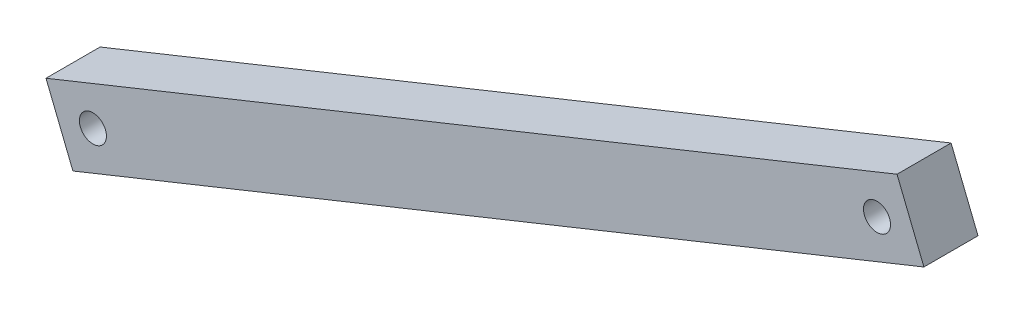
ISO-10303-21;
HEADER;
FILE_DESCRIPTION(('STEP AP214'),'2;1');
FILE_NAME('part.step','',(''),(''),'','','');
FILE_SCHEMA(('AUTOMOTIVE_DESIGN { 1 0 10303 214 1 1 1 1 }'));
ENDSEC;
DATA;
#1=APPLICATION_CONTEXT('core data for automotive mechanical design processes');
#2=APPLICATION_PROTOCOL_DEFINITION('international standard','automotive_design',2000,#1);
#3=PRODUCT_CONTEXT('',#1,'mechanical');
#4=PRODUCT('Part','Part','',(#3));
#5=PRODUCT_RELATED_PRODUCT_CATEGORY('part','',(#4));
#6=PRODUCT_DEFINITION_FORMATION('','',#4);
#7=PRODUCT_DEFINITION_CONTEXT('part definition',#1,'design');
#8=PRODUCT_DEFINITION('design','',#6,#7);
#9=PRODUCT_DEFINITION_SHAPE('','',#8);
#10=(LENGTH_UNIT() NAMED_UNIT(*) SI_UNIT(.MILLI.,.METRE.));
#11=(NAMED_UNIT(*) PLANE_ANGLE_UNIT() SI_UNIT($,.RADIAN.));
#12=(NAMED_UNIT(*) SI_UNIT($,.STERADIAN.) SOLID_ANGLE_UNIT());
#13=UNCERTAINTY_MEASURE_WITH_UNIT(LENGTH_MEASURE(1.E-05),#10,'distance_accuracy_value','');
#14=(GEOMETRIC_REPRESENTATION_CONTEXT(3) GLOBAL_UNCERTAINTY_ASSIGNED_CONTEXT((#13)) GLOBAL_UNIT_ASSIGNED_CONTEXT((#10,
#11,#12)) REPRESENTATION_CONTEXT('',''));
#15=CARTESIAN_POINT('',(0.,0.,0.));
#16=DIRECTION('',(0.,0.,1.));
#17=DIRECTION('',(1.,0.,0.));
#18=AXIS2_PLACEMENT_3D('',#15,#16,#17);
#19=CARTESIAN_POINT('',(-5.20387182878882,89.2180437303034,6.));
#20=DIRECTION('',(0.,0.,1.));
#21=DIRECTION('',(1.,0.,0.));
#22=AXIS2_PLACEMENT_3D('',#19,#20,#21);
#23=PLANE('',#22);
#24=CARTESIAN_POINT('',(87.,122.,6.));
#25=DIRECTION('',(0.,0.,1.));
#26=DIRECTION('',(1.,0.,0.));
#27=AXIS2_PLACEMENT_3D('',#24,#25,#26);
#28=CIRCLE('',#27,1.5);
#29=CARTESIAN_POINT('',(88.5,122.,6.));
#30=VERTEX_POINT('',#29);
#31=EDGE_CURVE('E85',#30,#30,#28,.T.);
#32=ORIENTED_EDGE('',*,*,#31,.F.);
#33=EDGE_LOOP('',(#32));
#34=FACE_BOUND('',#33,.T.);
#35=DIRECTION('',(-0.927739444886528,-0.373228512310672,0.));
#36=VECTOR('',#35,1.);
#37=CARTESIAN_POINT('',(89.2180437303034,127.203871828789,6.));
#38=LINE('',#37,#36);
#39=CARTESIAN_POINT('',(89.2180437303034,127.203871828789,6.));
#40=VERTEX_POINT('',#39);
#41=CARTESIAN_POINT('',(-5.20387182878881,89.2180437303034,6.));
#42=VERTEX_POINT('',#41);
#43=EDGE_CURVE('E95',#40,#42,#38,.T.);
#44=ORIENTED_EDGE('',*,*,#43,.T.);
#45=DIRECTION('',(0.373228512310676,-0.927739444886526,0.));
#46=VECTOR('',#45,1.);
#47=CARTESIAN_POINT('',(-5.20387182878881,89.2180437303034,6.));
#48=LINE('',#47,#46);
#49=CARTESIAN_POINT('',(-2.21804373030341,81.7961281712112,6.));
#50=VERTEX_POINT('',#49);
#51=EDGE_CURVE('E80',#42,#50,#48,.T.);
#52=ORIENTED_EDGE('',*,*,#51,.T.);
#53=DIRECTION('',(0.927739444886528,0.373228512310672,0.));
#54=VECTOR('',#53,1.);
#55=CARTESIAN_POINT('',(-2.21804373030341,81.7961281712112,6.));
#56=LINE('',#55,#54);
#57=CARTESIAN_POINT('',(92.2038718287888,119.781956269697,6.));
#58=VERTEX_POINT('',#57);
#59=EDGE_CURVE('E46',#50,#58,#56,.T.);
#60=ORIENTED_EDGE('',*,*,#59,.T.);
#61=DIRECTION('',(-0.373228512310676,0.927739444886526,0.));
#62=VECTOR('',#61,1.);
#63=CARTESIAN_POINT('',(89.2180437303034,127.203871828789,6.));
#64=LINE('',#63,#62);
#65=EDGE_CURVE('E41',#58,#40,#64,.T.);
#66=ORIENTED_EDGE('',*,*,#65,.T.);
#67=EDGE_LOOP('',(#44,#52,#60,#66));
#68=FACE_BOUND('',#67,.T.);
#69=CARTESIAN_POINT('',(0.,87.,6.));
#70=DIRECTION('',(0.,0.,1.));
#71=DIRECTION('',(1.,0.,0.));
#72=AXIS2_PLACEMENT_3D('',#69,#70,#71);
#73=CIRCLE('',#72,1.5);
#74=CARTESIAN_POINT('',(1.5,87.,6.));
#75=VERTEX_POINT('',#74);
#76=EDGE_CURVE('E113',#75,#75,#73,.T.);
#77=ORIENTED_EDGE('',*,*,#76,.F.);
#78=EDGE_LOOP('',(#77));
#79=FACE_BOUND('',#78,.T.);
#80=ADVANCED_FACE('F26',(#34,#68,#79),#23,.T.);
#81=CARTESIAN_POINT('',(-5.20387182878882,89.2180437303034,0.));
#82=DIRECTION('',(0.,0.,1.));
#83=DIRECTION('',(1.,0.,0.));
#84=AXIS2_PLACEMENT_3D('',#81,#82,#83);
#85=PLANE('',#84);
#86=CARTESIAN_POINT('',(87.,122.,0.));
#87=DIRECTION('',(0.,0.,1.));
#88=DIRECTION('',(1.,0.,0.));
#89=AXIS2_PLACEMENT_3D('',#86,#87,#88);
#90=CIRCLE('',#89,1.5);
#91=CARTESIAN_POINT('',(88.5,122.,0.));
#92=VERTEX_POINT('',#91);
#93=EDGE_CURVE('E88',#92,#92,#90,.T.);
#94=ORIENTED_EDGE('',*,*,#93,.T.);
#95=EDGE_LOOP('',(#94));
#96=FACE_BOUND('',#95,.T.);
#97=DIRECTION('',(-0.927739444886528,-0.373228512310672,0.));
#98=VECTOR('',#97,1.);
#99=CARTESIAN_POINT('',(89.2180437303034,127.203871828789,0.));
#100=LINE('',#99,#98);
#101=CARTESIAN_POINT('',(89.2180437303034,127.203871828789,0.));
#102=VERTEX_POINT('',#101);
#103=CARTESIAN_POINT('',(-5.20387182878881,89.2180437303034,0.));
#104=VERTEX_POINT('',#103);
#105=EDGE_CURVE('E72',#102,#104,#100,.T.);
#106=ORIENTED_EDGE('',*,*,#105,.F.);
#107=DIRECTION('',(-0.373228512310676,0.927739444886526,0.));
#108=VECTOR('',#107,1.);
#109=CARTESIAN_POINT('',(89.2180437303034,127.203871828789,0.));
#110=LINE('',#109,#108);
#111=CARTESIAN_POINT('',(92.2038718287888,119.781956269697,0.));
#112=VERTEX_POINT('',#111);
#113=EDGE_CURVE('E93',#112,#102,#110,.T.);
#114=ORIENTED_EDGE('',*,*,#113,.F.);
#115=DIRECTION('',(0.927739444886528,0.373228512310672,0.));
#116=VECTOR('',#115,1.);
#117=CARTESIAN_POINT('',(-2.21804373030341,81.7961281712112,0.));
#118=LINE('',#117,#116);
#119=CARTESIAN_POINT('',(-2.21804373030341,81.7961281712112,0.));
#120=VERTEX_POINT('',#119);
#121=EDGE_CURVE('E73',#120,#112,#118,.T.);
#122=ORIENTED_EDGE('',*,*,#121,.F.);
#123=DIRECTION('',(0.373228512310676,-0.927739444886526,0.));
#124=VECTOR('',#123,1.);
#125=CARTESIAN_POINT('',(-5.20387182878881,89.2180437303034,0.));
#126=LINE('',#125,#124);
#127=EDGE_CURVE('E67',#104,#120,#126,.T.);
#128=ORIENTED_EDGE('',*,*,#127,.F.);
#129=EDGE_LOOP('',(#106,#114,#122,#128));
#130=FACE_BOUND('',#129,.T.);
#131=CARTESIAN_POINT('',(0.,87.,0.));
#132=DIRECTION('',(0.,0.,1.));
#133=DIRECTION('',(1.,0.,0.));
#134=AXIS2_PLACEMENT_3D('',#131,#132,#133);
#135=CIRCLE('',#134,1.5);
#136=CARTESIAN_POINT('',(1.5,87.,0.));
#137=VERTEX_POINT('',#136);
#138=EDGE_CURVE('E115',#137,#137,#135,.T.);
#139=ORIENTED_EDGE('',*,*,#138,.T.);
#140=EDGE_LOOP('',(#139));
#141=FACE_BOUND('',#140,.T.);
#142=ADVANCED_FACE('F68',(#96,#130,#141),#85,.F.);
#143=CARTESIAN_POINT('',(89.2180437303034,127.203871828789,6.));
#144=DIRECTION('',(0.373228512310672,-0.927739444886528,0.));
#145=DIRECTION('',(0.927739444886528,0.373228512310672,0.));
#146=AXIS2_PLACEMENT_3D('',#143,#144,#145);
#147=PLANE('',#146);
#148=ORIENTED_EDGE('',*,*,#105,.T.);
#149=DIRECTION('',(0.,0.,-1.));
#150=VECTOR('',#149,1.);
#151=CARTESIAN_POINT('',(-5.20387182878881,89.2180437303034,6.));
#152=LINE('',#151,#150);
#153=EDGE_CURVE('E11',#42,#104,#152,.T.);
#154=ORIENTED_EDGE('',*,*,#153,.F.);
#155=ORIENTED_EDGE('',*,*,#43,.F.);
#156=DIRECTION('',(0.,0.,-1.));
#157=VECTOR('',#156,1.);
#158=CARTESIAN_POINT('',(89.2180437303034,127.203871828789,6.));
#159=LINE('',#158,#157);
#160=EDGE_CURVE('E84',#40,#102,#159,.T.);
#161=ORIENTED_EDGE('',*,*,#160,.T.);
#162=EDGE_LOOP('',(#148,#154,#155,#161));
#163=FACE_BOUND('',#162,.T.);
#164=ADVANCED_FACE('F28',(#163),#147,.F.);
#165=CARTESIAN_POINT('',(-5.20387182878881,89.2180437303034,6.));
#166=DIRECTION('',(0.927739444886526,0.373228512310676,0.));
#167=DIRECTION('',(-0.373228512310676,0.927739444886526,0.));
#168=AXIS2_PLACEMENT_3D('',#165,#166,#167);
#169=PLANE('',#168);
#170=ORIENTED_EDGE('',*,*,#127,.T.);
#171=DIRECTION('',(0.,0.,-1.));
#172=VECTOR('',#171,1.);
#173=CARTESIAN_POINT('',(-2.21804373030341,81.7961281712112,6.));
#174=LINE('',#173,#172);
#175=EDGE_CURVE('E34',#50,#120,#174,.T.);
#176=ORIENTED_EDGE('',*,*,#175,.F.);
#177=ORIENTED_EDGE('',*,*,#51,.F.);
#178=ORIENTED_EDGE('',*,*,#153,.T.);
#179=EDGE_LOOP('',(#170,#176,#177,#178));
#180=FACE_BOUND('',#179,.T.);
#181=ADVANCED_FACE('F79',(#180),#169,.F.);
#182=CARTESIAN_POINT('',(-2.21804373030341,81.7961281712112,6.));
#183=DIRECTION('',(-0.373228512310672,0.927739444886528,0.));
#184=DIRECTION('',(-0.927739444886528,-0.373228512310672,0.));
#185=AXIS2_PLACEMENT_3D('',#182,#183,#184);
#186=PLANE('',#185);
#187=ORIENTED_EDGE('',*,*,#121,.T.);
#188=DIRECTION('',(0.,0.,-1.));
#189=VECTOR('',#188,1.);
#190=CARTESIAN_POINT('',(92.2038718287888,119.781956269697,6.));
#191=LINE('',#190,#189);
#192=EDGE_CURVE('E101',#58,#112,#191,.T.);
#193=ORIENTED_EDGE('',*,*,#192,.F.);
#194=ORIENTED_EDGE('',*,*,#59,.F.);
#195=ORIENTED_EDGE('',*,*,#175,.T.);
#196=EDGE_LOOP('',(#187,#193,#194,#195));
#197=FACE_BOUND('',#196,.T.);
#198=ADVANCED_FACE('F104',(#197),#186,.F.);
#199=CARTESIAN_POINT('',(89.2180437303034,127.203871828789,6.));
#200=DIRECTION('',(-0.927739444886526,-0.373228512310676,0.));
#201=DIRECTION('',(0.373228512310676,-0.927739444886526,0.));
#202=AXIS2_PLACEMENT_3D('',#199,#200,#201);
#203=PLANE('',#202);
#204=ORIENTED_EDGE('',*,*,#113,.T.);
#205=ORIENTED_EDGE('',*,*,#160,.F.);
#206=ORIENTED_EDGE('',*,*,#65,.F.);
#207=ORIENTED_EDGE('',*,*,#192,.T.);
#208=EDGE_LOOP('',(#204,#205,#206,#207));
#209=FACE_BOUND('',#208,.T.);
#210=ADVANCED_FACE('F106',(#209),#203,.F.);
#211=CARTESIAN_POINT('',(87.,122.,6.));
#212=DIRECTION('',(0.,0.,-1.));
#213=DIRECTION('',(-1.,0.,0.));
#214=AXIS2_PLACEMENT_3D('',#211,#212,#213);
#215=CYLINDRICAL_SURFACE('',#214,1.5);
#216=ORIENTED_EDGE('',*,*,#31,.T.);
#217=EDGE_LOOP('',(#216));
#218=FACE_BOUND('',#217,.T.);
#219=ORIENTED_EDGE('',*,*,#93,.F.);
#220=EDGE_LOOP('',(#219));
#221=FACE_BOUND('',#220,.T.);
#222=ADVANCED_FACE('F124',(#218,#221),#215,.F.);
#223=CARTESIAN_POINT('',(0.,87.,6.));
#224=DIRECTION('',(0.,0.,-1.));
#225=DIRECTION('',(-1.,0.,0.));
#226=AXIS2_PLACEMENT_3D('',#223,#224,#225);
#227=CYLINDRICAL_SURFACE('',#226,1.5);
#228=ORIENTED_EDGE('',*,*,#76,.T.);
#229=EDGE_LOOP('',(#228));
#230=FACE_BOUND('',#229,.T.);
#231=ORIENTED_EDGE('',*,*,#138,.F.);
#232=EDGE_LOOP('',(#231));
#233=FACE_BOUND('',#232,.T.);
#234=ADVANCED_FACE('F122',(#230,#233),#227,.F.);
#235=CLOSED_SHELL('',(#80,#142,#164,#181,#198,#210,#222,#234));
#236=MANIFOLD_SOLID_BREP('B2',#235);
#237=ADVANCED_BREP_SHAPE_REPRESENTATION('',(#18,#236),#14);
#238=SHAPE_DEFINITION_REPRESENTATION(#9,#237);
ENDSEC;
END-ISO-10303-21;
